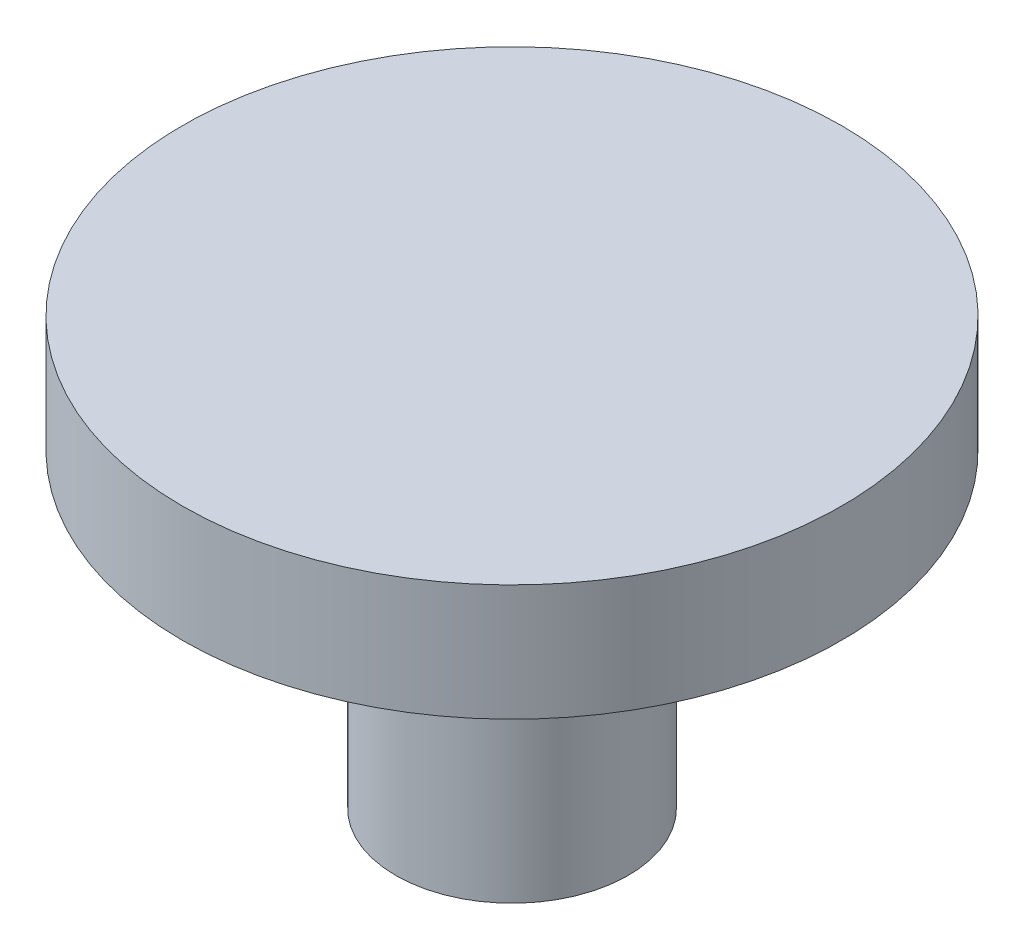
from build123d import *


with BuildPart() as part:
    # Esquisse1 → R_volution1 (revolve)
    with BuildSketch(Plane.XY, mode=Mode.PRIVATE) as r_volution1_sk:
        Polygon((0, 1.5), (-4.25, 1.5), (-4.25, 0), (-1.5, 0), (-1.5, -4), (0, -4), align=None)
    revolve(r_volution1_sk.sketch.rotate(Axis((0, 3.412315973, 0), (0, -1, 0)), 270), axis=Axis((0, 3.412315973, 0), (0, -1, 0)))


solid = part.part
